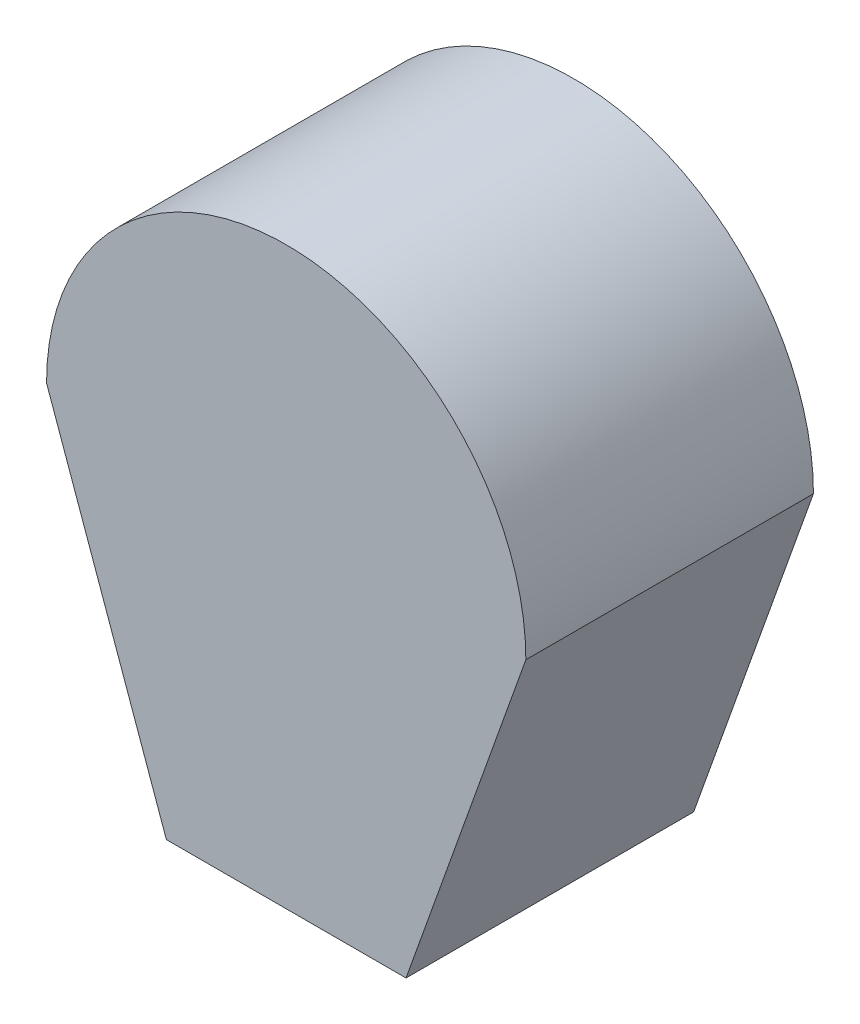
ISO-10303-21;
HEADER;
FILE_DESCRIPTION(('STEP AP214'),'2;1');
FILE_NAME('part.step','',(''),(''),'','','');
FILE_SCHEMA(('AUTOMOTIVE_DESIGN { 1 0 10303 214 1 1 1 1 }'));
ENDSEC;
DATA;
#1=APPLICATION_CONTEXT('core data for automotive mechanical design processes');
#2=APPLICATION_PROTOCOL_DEFINITION('international standard','automotive_design',2000,#1);
#3=PRODUCT_CONTEXT('',#1,'mechanical');
#4=PRODUCT('Part','Part','',(#3));
#5=PRODUCT_RELATED_PRODUCT_CATEGORY('part','',(#4));
#6=PRODUCT_DEFINITION_FORMATION('','',#4);
#7=PRODUCT_DEFINITION_CONTEXT('part definition',#1,'design');
#8=PRODUCT_DEFINITION('design','',#6,#7);
#9=PRODUCT_DEFINITION_SHAPE('','',#8);
#10=(LENGTH_UNIT() NAMED_UNIT(*) SI_UNIT(.MILLI.,.METRE.));
#11=(NAMED_UNIT(*) PLANE_ANGLE_UNIT() SI_UNIT($,.RADIAN.));
#12=(NAMED_UNIT(*) SI_UNIT($,.STERADIAN.) SOLID_ANGLE_UNIT());
#13=UNCERTAINTY_MEASURE_WITH_UNIT(LENGTH_MEASURE(1.E-05),#10,'distance_accuracy_value','');
#14=(GEOMETRIC_REPRESENTATION_CONTEXT(3) GLOBAL_UNCERTAINTY_ASSIGNED_CONTEXT((#13)) GLOBAL_UNIT_ASSIGNED_CONTEXT((#10,
#11,#12)) REPRESENTATION_CONTEXT('',''));
#15=CARTESIAN_POINT('',(0.,0.,0.));
#16=DIRECTION('',(0.,0.,1.));
#17=DIRECTION('',(1.,0.,0.));
#18=AXIS2_PLACEMENT_3D('',#15,#16,#17);
#19=CARTESIAN_POINT('',(0.,0.,-30.));
#20=DIRECTION('',(0.,0.,1.));
#21=DIRECTION('',(1.,0.,0.));
#22=AXIS2_PLACEMENT_3D('',#19,#20,#21);
#23=CYLINDRICAL_SURFACE('',#22,50.);
#24=DIRECTION('',(0.,0.,1.));
#25=VECTOR('',#24,1.);
#26=CARTESIAN_POINT('',(-50.,0.,-30.));
#27=LINE('',#26,#25);
#28=CARTESIAN_POINT('',(-50.,0.,-30.));
#29=VERTEX_POINT('',#28);
#30=CARTESIAN_POINT('',(-50.,0.,30.));
#31=VERTEX_POINT('',#30);
#32=EDGE_CURVE('E36',#29,#31,#27,.T.);
#33=ORIENTED_EDGE('',*,*,#32,.T.);
#34=CARTESIAN_POINT('',(0.,0.,30.));
#35=DIRECTION('',(0.,0.,1.));
#36=DIRECTION('',(1.,0.,0.));
#37=AXIS2_PLACEMENT_3D('',#34,#35,#36);
#38=CIRCLE('',#37,50.);
#39=CARTESIAN_POINT('',(50.,0.,30.));
#40=VERTEX_POINT('',#39);
#41=EDGE_CURVE('E74',#40,#31,#38,.T.);
#42=ORIENTED_EDGE('',*,*,#41,.F.);
#43=DIRECTION('',(0.,0.,1.));
#44=VECTOR('',#43,1.);
#45=CARTESIAN_POINT('',(50.,0.,-30.));
#46=LINE('',#45,#44);
#47=CARTESIAN_POINT('',(50.,0.,-30.));
#48=VERTEX_POINT('',#47);
#49=EDGE_CURVE('E41',#48,#40,#46,.T.);
#50=ORIENTED_EDGE('',*,*,#49,.F.);
#51=CARTESIAN_POINT('',(0.,0.,-30.));
#52=DIRECTION('',(0.,0.,1.));
#53=DIRECTION('',(1.,0.,0.));
#54=AXIS2_PLACEMENT_3D('',#51,#52,#53);
#55=CIRCLE('',#54,50.);
#56=EDGE_CURVE('E75',#48,#29,#55,.T.);
#57=ORIENTED_EDGE('',*,*,#56,.T.);
#58=EDGE_LOOP('',(#33,#42,#50,#57));
#59=FACE_BOUND('',#58,.T.);
#60=ADVANCED_FACE('F33',(#59),#23,.T.);
#61=CARTESIAN_POINT('',(50.,0.,-30.));
#62=DIRECTION('',(0.941741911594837,-0.336336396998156,0.));
#63=DIRECTION('',(0.336336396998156,0.941741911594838,0.));
#64=AXIS2_PLACEMENT_3D('',#61,#62,#63);
#65=PLANE('',#64);
#66=ORIENTED_EDGE('',*,*,#49,.T.);
#67=DIRECTION('',(0.336336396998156,0.941741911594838,0.));
#68=VECTOR('',#67,1.);
#69=CARTESIAN_POINT('',(50.,0.,30.));
#70=LINE('',#69,#68);
#71=CARTESIAN_POINT('',(25.,-70.,30.));
#72=VERTEX_POINT('',#71);
#73=EDGE_CURVE('E92',#72,#40,#70,.T.);
#74=ORIENTED_EDGE('',*,*,#73,.F.);
#75=DIRECTION('',(0.,0.,1.));
#76=VECTOR('',#75,1.);
#77=CARTESIAN_POINT('',(25.,-70.,-30.));
#78=LINE('',#77,#76);
#79=CARTESIAN_POINT('',(25.,-70.,-30.));
#80=VERTEX_POINT('',#79);
#81=EDGE_CURVE('E107',#80,#72,#78,.T.);
#82=ORIENTED_EDGE('',*,*,#81,.F.);
#83=DIRECTION('',(0.336336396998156,0.941741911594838,0.));
#84=VECTOR('',#83,1.);
#85=CARTESIAN_POINT('',(50.,0.,-30.));
#86=LINE('',#85,#84);
#87=EDGE_CURVE('E80',#80,#48,#86,.T.);
#88=ORIENTED_EDGE('',*,*,#87,.T.);
#89=EDGE_LOOP('',(#66,#74,#82,#88));
#90=FACE_BOUND('',#89,.T.);
#91=ADVANCED_FACE('F111',(#90),#65,.T.);
#92=CARTESIAN_POINT('',(0.,-70.,-30.));
#93=DIRECTION('',(0.,-1.,0.));
#94=DIRECTION('',(0.,0.,-1.));
#95=AXIS2_PLACEMENT_3D('',#92,#93,#94);
#96=PLANE('',#95);
#97=CARTESIAN_POINT('',(0.,-70.,0.));
#98=DIRECTION('',(0.,-1.,0.));
#99=DIRECTION('',(0.,0.,-1.));
#100=AXIS2_PLACEMENT_3D('',#97,#98,#99);
#101=CIRCLE('',#100,15.);
#102=CARTESIAN_POINT('',(0.,-70.,-15.));
#103=VERTEX_POINT('',#102);
#104=EDGE_CURVE('E11',#103,#103,#101,.T.);
#105=ORIENTED_EDGE('',*,*,#104,.F.);
#106=EDGE_LOOP('',(#105));
#107=FACE_BOUND('',#106,.T.);
#108=ORIENTED_EDGE('',*,*,#81,.T.);
#109=DIRECTION('',(1.,0.,0.));
#110=VECTOR('',#109,1.);
#111=CARTESIAN_POINT('',(0.,-70.,30.));
#112=LINE('',#111,#110);
#113=CARTESIAN_POINT('',(-25.,-70.,30.));
#114=VERTEX_POINT('',#113);
#115=EDGE_CURVE('E87',#114,#72,#112,.T.);
#116=ORIENTED_EDGE('',*,*,#115,.F.);
#117=DIRECTION('',(0.,0.,1.));
#118=VECTOR('',#117,1.);
#119=CARTESIAN_POINT('',(-25.,-70.,-30.));
#120=LINE('',#119,#118);
#121=CARTESIAN_POINT('',(-25.,-70.,-30.));
#122=VERTEX_POINT('',#121);
#123=EDGE_CURVE('E79',#122,#114,#120,.T.);
#124=ORIENTED_EDGE('',*,*,#123,.F.);
#125=DIRECTION('',(1.,0.,0.));
#126=VECTOR('',#125,1.);
#127=CARTESIAN_POINT('',(0.,-70.,-30.));
#128=LINE('',#127,#126);
#129=EDGE_CURVE('E56',#122,#80,#128,.T.);
#130=ORIENTED_EDGE('',*,*,#129,.T.);
#131=EDGE_LOOP('',(#108,#116,#124,#130));
#132=FACE_BOUND('',#131,.T.);
#133=ADVANCED_FACE('F108',(#107,#132),#96,.T.);
#134=CARTESIAN_POINT('',(-25.,-70.,-30.));
#135=DIRECTION('',(-0.941741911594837,-0.336336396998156,0.));
#136=DIRECTION('',(0.336336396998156,-0.941741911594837,0.));
#137=AXIS2_PLACEMENT_3D('',#134,#135,#136);
#138=PLANE('',#137);
#139=ORIENTED_EDGE('',*,*,#123,.T.);
#140=DIRECTION('',(0.336336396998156,-0.941741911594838,0.));
#141=VECTOR('',#140,1.);
#142=CARTESIAN_POINT('',(-25.,-70.,30.));
#143=LINE('',#142,#141);
#144=EDGE_CURVE('E82',#31,#114,#143,.T.);
#145=ORIENTED_EDGE('',*,*,#144,.F.);
#146=ORIENTED_EDGE('',*,*,#32,.F.);
#147=DIRECTION('',(0.336336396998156,-0.941741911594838,0.));
#148=VECTOR('',#147,1.);
#149=CARTESIAN_POINT('',(-25.,-70.,-30.));
#150=LINE('',#149,#148);
#151=EDGE_CURVE('E101',#29,#122,#150,.T.);
#152=ORIENTED_EDGE('',*,*,#151,.T.);
#153=EDGE_LOOP('',(#139,#145,#146,#152));
#154=FACE_BOUND('',#153,.T.);
#155=ADVANCED_FACE('F83',(#154),#138,.T.);
#156=CARTESIAN_POINT('',(0.,0.,-30.));
#157=DIRECTION('',(0.,0.,1.));
#158=DIRECTION('',(1.,0.,0.));
#159=AXIS2_PLACEMENT_3D('',#156,#157,#158);
#160=PLANE('',#159);
#161=ORIENTED_EDGE('',*,*,#56,.F.);
#162=ORIENTED_EDGE('',*,*,#87,.F.);
#163=ORIENTED_EDGE('',*,*,#129,.F.);
#164=ORIENTED_EDGE('',*,*,#151,.F.);
#165=EDGE_LOOP('',(#161,#162,#163,#164));
#166=FACE_BOUND('',#165,.T.);
#167=ADVANCED_FACE('F113',(#166),#160,.F.);
#168=CARTESIAN_POINT('',(0.,0.,30.));
#169=DIRECTION('',(0.,0.,1.));
#170=DIRECTION('',(1.,0.,0.));
#171=AXIS2_PLACEMENT_3D('',#168,#169,#170);
#172=PLANE('',#171);
#173=ORIENTED_EDGE('',*,*,#41,.T.);
#174=ORIENTED_EDGE('',*,*,#144,.T.);
#175=ORIENTED_EDGE('',*,*,#115,.T.);
#176=ORIENTED_EDGE('',*,*,#73,.T.);
#177=EDGE_LOOP('',(#173,#174,#175,#176));
#178=FACE_BOUND('',#177,.T.);
#179=ADVANCED_FACE('F90',(#178),#172,.T.);
#180=CARTESIAN_POINT('',(0.,-75.,0.));
#181=DIRECTION('',(0.,1.,0.));
#182=DIRECTION('',(0.,0.,1.));
#183=AXIS2_PLACEMENT_3D('',#180,#181,#182);
#184=CYLINDRICAL_SURFACE('',#183,15.);
#185=CARTESIAN_POINT('',(0.,-75.,0.));
#186=DIRECTION('',(0.,-1.,0.));
#187=DIRECTION('',(0.,0.,-1.));
#188=AXIS2_PLACEMENT_3D('',#185,#186,#187);
#189=CIRCLE('',#188,15.);
#190=CARTESIAN_POINT('',(0.,-75.,-15.));
#191=VERTEX_POINT('',#190);
#192=EDGE_CURVE('E93',#191,#191,#189,.T.);
#193=ORIENTED_EDGE('',*,*,#192,.F.);
#194=EDGE_LOOP('',(#193));
#195=FACE_BOUND('',#194,.T.);
#196=ORIENTED_EDGE('',*,*,#104,.T.);
#197=EDGE_LOOP('',(#196));
#198=FACE_BOUND('',#197,.T.);
#199=ADVANCED_FACE('F120',(#195,#198),#184,.T.);
#200=CARTESIAN_POINT('',(0.,-75.,0.));
#201=DIRECTION('',(0.,-1.,0.));
#202=DIRECTION('',(0.,0.,-1.));
#203=AXIS2_PLACEMENT_3D('',#200,#201,#202);
#204=PLANE('',#203);
#205=ORIENTED_EDGE('',*,*,#192,.T.);
#206=EDGE_LOOP('',(#205));
#207=FACE_BOUND('',#206,.T.);
#208=ADVANCED_FACE('F137',(#207),#204,.T.);
#209=CLOSED_SHELL('',(#60,#91,#133,#155,#167,#179,#199,#208));
#210=MANIFOLD_SOLID_BREP('B2',#209);
#211=ADVANCED_BREP_SHAPE_REPRESENTATION('',(#18,#210),#14);
#212=SHAPE_DEFINITION_REPRESENTATION(#9,#211);
ENDSEC;
END-ISO-10303-21;
